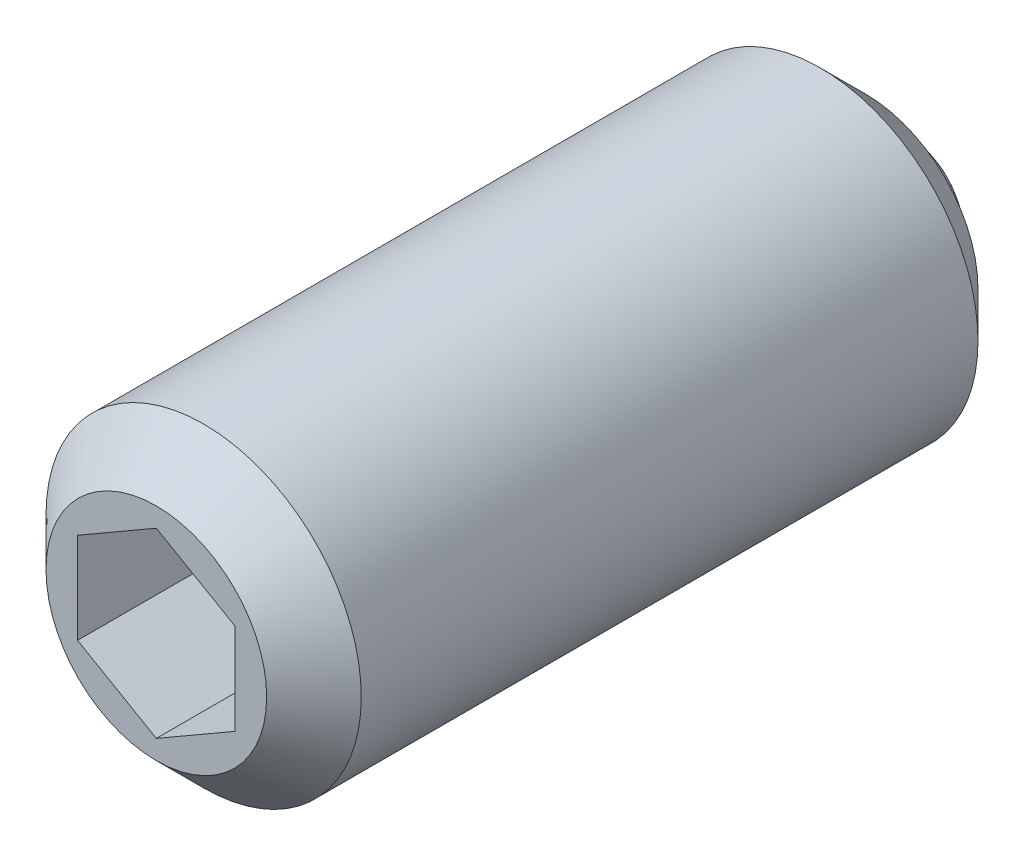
ISO-10303-21;
HEADER;
FILE_DESCRIPTION(('STEP AP214'),'2;1');
FILE_NAME('part.step','',(''),(''),'','','');
FILE_SCHEMA(('AUTOMOTIVE_DESIGN { 1 0 10303 214 1 1 1 1 }'));
ENDSEC;
DATA;
#1=APPLICATION_CONTEXT('core data for automotive mechanical design processes');
#2=APPLICATION_PROTOCOL_DEFINITION('international standard','automotive_design',2000,#1);
#3=PRODUCT_CONTEXT('',#1,'mechanical');
#4=PRODUCT('Part','Part','',(#3));
#5=PRODUCT_RELATED_PRODUCT_CATEGORY('part','',(#4));
#6=PRODUCT_DEFINITION_FORMATION('','',#4);
#7=PRODUCT_DEFINITION_CONTEXT('part definition',#1,'design');
#8=PRODUCT_DEFINITION('design','',#6,#7);
#9=PRODUCT_DEFINITION_SHAPE('','',#8);
#10=(LENGTH_UNIT() NAMED_UNIT(*) SI_UNIT(.MILLI.,.METRE.));
#11=(NAMED_UNIT(*) PLANE_ANGLE_UNIT() SI_UNIT($,.RADIAN.));
#12=(NAMED_UNIT(*) SI_UNIT($,.STERADIAN.) SOLID_ANGLE_UNIT());
#13=UNCERTAINTY_MEASURE_WITH_UNIT(LENGTH_MEASURE(1.E-05),#10,'distance_accuracy_value','');
#14=(GEOMETRIC_REPRESENTATION_CONTEXT(3) GLOBAL_UNCERTAINTY_ASSIGNED_CONTEXT((#13)) GLOBAL_UNIT_ASSIGNED_CONTEXT((#10,
#11,#12)) REPRESENTATION_CONTEXT('',''));
#15=CARTESIAN_POINT('',(0.,0.,0.));
#16=DIRECTION('',(0.,0.,1.));
#17=DIRECTION('',(1.,0.,0.));
#18=AXIS2_PLACEMENT_3D('',#15,#16,#17);
#19=CARTESIAN_POINT('',(2.0000000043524,-2.33711386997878,15.4999999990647));
#20=DIRECTION('',(-2.80800014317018E-10,1.5992106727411E-10,-1.));
#21=DIRECTION('',(-1.,0.,2.80800014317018E-10));
#22=AXIS2_PLACEMENT_3D('',#19,#20,#21);
#23=PLANE('',#22);
#24=DIRECTION('',(-0.866025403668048,-0.500000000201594,1.63219412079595E-10));
#25=VECTOR('',#24,1.);
#26=CARTESIAN_POINT('',(-0.999999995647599,1.73205082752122,15.5000000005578));
#27=LINE('',#26,#25);
#28=CARTESIAN_POINT('',(3.78801077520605E-09,2.30940109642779,15.5000000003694));
#29=VERTEX_POINT('',#28);
#30=CARTESIAN_POINT('',(-1.9999999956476,1.15470055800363,15.5000000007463));
#31=VERTEX_POINT('',#30);
#32=EDGE_CURVE('E102',#29,#31,#27,.T.);
#33=ORIENTED_EDGE('',*,*,#32,.T.);
#34=DIRECTION('',(0.,-1.,-1.5992106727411E-10));
#35=VECTOR('',#34,1.);
#36=CARTESIAN_POINT('',(-1.9999999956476,2.00212238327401E-08,15.5000000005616));
#37=LINE('',#36,#35);
#38=CARTESIAN_POINT('',(-1.9999999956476,-1.15470051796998,15.500000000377));
#39=VERTEX_POINT('',#38);
#40=EDGE_CURVE('E84',#31,#39,#37,.T.);
#41=ORIENTED_EDGE('',*,*,#40,.T.);
#42=DIRECTION('',(0.866025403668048,-0.500000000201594,-3.23140479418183E-10));
#43=VECTOR('',#42,1.);
#44=CARTESIAN_POINT('',(-0.9999999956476,-1.73205078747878,15.5000000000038));
#45=LINE('',#44,#43);
#46=CARTESIAN_POINT('',(4.9167897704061E-09,-2.30940105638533,15.4999999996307));
#47=VERTEX_POINT('',#46);
#48=EDGE_CURVE('E88',#39,#47,#45,.T.);
#49=ORIENTED_EDGE('',*,*,#48,.T.);
#50=DIRECTION('',(0.866025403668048,0.500000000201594,-1.63219412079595E-10));
#51=VECTOR('',#50,1.);
#52=CARTESIAN_POINT('',(1.0000000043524,-1.73205078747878,15.4999999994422));
#53=LINE('',#52,#51);
#54=CARTESIAN_POINT('',(2.0000000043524,-1.15470051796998,15.4999999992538));
#55=VERTEX_POINT('',#54);
#56=EDGE_CURVE('E93',#47,#55,#53,.T.);
#57=ORIENTED_EDGE('',*,*,#56,.T.);
#58=DIRECTION('',(0.,1.,1.5992106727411E-10));
#59=VECTOR('',#58,1.);
#60=CARTESIAN_POINT('',(2.0000000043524,2.00212230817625E-08,15.4999999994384));
#61=LINE('',#60,#59);
#62=CARTESIAN_POINT('',(2.0000000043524,1.15470055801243,15.4999999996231));
#63=VERTEX_POINT('',#62);
#64=EDGE_CURVE('E96',#55,#63,#61,.T.);
#65=ORIENTED_EDGE('',*,*,#64,.T.);
#66=DIRECTION('',(-0.866025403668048,0.500000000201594,3.23140479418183E-10));
#67=VECTOR('',#66,1.);
#68=CARTESIAN_POINT('',(1.0000000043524,1.73205082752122,15.4999999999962));
#69=LINE('',#68,#67);
#70=EDGE_CURVE('E99',#63,#29,#69,.T.);
#71=ORIENTED_EDGE('',*,*,#70,.T.);
#72=EDGE_LOOP('',(#33,#41,#49,#57,#65,#71));
#73=FACE_BOUND('',#72,.T.);
#74=ADVANCED_FACE('F14',(#73),#23,.F.);
#75=CARTESIAN_POINT('',(-1.9999999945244,-1.15470051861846,19.500000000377));
#76=DIRECTION('',(-1.,0.,2.80800014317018E-10));
#77=DIRECTION('',(0.,1.,1.5992106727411E-10));
#78=AXIS2_PLACEMENT_3D('',#75,#76,#77);
#79=PLANE('',#78);
#80=DIRECTION('',(-2.80800014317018E-10,1.5992106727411E-10,-1.));
#81=VECTOR('',#80,1.);
#82=CARTESIAN_POINT('',(-1.999999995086,-1.15470051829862,17.500000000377));
#83=LINE('',#82,#81);
#84=CARTESIAN_POINT('',(-1.9999999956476,-1.15470051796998,19.500000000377));
#85=VERTEX_POINT('',#84);
#86=EDGE_CURVE('E85',#85,#39,#83,.T.);
#87=ORIENTED_EDGE('',*,*,#86,.T.);
#88=ORIENTED_EDGE('',*,*,#40,.F.);
#89=DIRECTION('',(2.80800014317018E-10,-1.5992106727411E-10,1.));
#90=VECTOR('',#89,1.);
#91=CARTESIAN_POINT('',(-1.999999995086,1.15470055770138,17.5000000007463));
#92=LINE('',#91,#90);
#93=CARTESIAN_POINT('',(-1.9999999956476,1.15470055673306,19.5000000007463));
#94=VERTEX_POINT('',#93);
#95=EDGE_CURVE('E54',#31,#94,#92,.T.);
#96=ORIENTED_EDGE('',*,*,#95,.T.);
#97=DIRECTION('',(0.,-1.,-1.5992106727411E-10));
#98=VECTOR('',#97,1.);
#99=CARTESIAN_POINT('',(-1.9999999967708,1.93815395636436E-08,19.5000000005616));
#100=LINE('',#99,#98);
#101=EDGE_CURVE('E48',#94,#85,#100,.T.);
#102=ORIENTED_EDGE('',*,*,#101,.T.);
#103=EDGE_LOOP('',(#87,#88,#96,#102));
#104=FACE_BOUND('',#103,.T.);
#105=ADVANCED_FACE('F150',(#104),#79,.F.);
#106=CARTESIAN_POINT('',(5.47559984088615E-09,-2.30940105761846,19.4999999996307));
#107=DIRECTION('',(-0.500000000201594,-0.866025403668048,1.90430037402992E-12));
#108=DIRECTION('',(-0.866025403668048,0.500000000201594,3.23140479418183E-10));
#109=AXIS2_PLACEMENT_3D('',#106,#107,#108);
#110=PLANE('',#109);
#111=DIRECTION('',(-2.80800014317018E-10,1.5992106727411E-10,-1.));
#112=VECTOR('',#111,1.);
#113=CARTESIAN_POINT('',(4.91399981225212E-09,-2.30940105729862,17.4999999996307));
#114=LINE('',#113,#112);
#115=CARTESIAN_POINT('',(5.47559989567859E-09,-2.30940105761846,19.4999999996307));
#116=VERTEX_POINT('',#115);
#117=EDGE_CURVE('E92',#116,#47,#114,.T.);
#118=ORIENTED_EDGE('',*,*,#117,.T.);
#119=ORIENTED_EDGE('',*,*,#48,.F.);
#120=ORIENTED_EDGE('',*,*,#86,.F.);
#121=DIRECTION('',(-0.866025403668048,0.500000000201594,3.23140479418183E-10));
#122=VECTOR('',#121,1.);
#123=CARTESIAN_POINT('',(5.47559984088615E-09,-2.30940105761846,19.4999999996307));
#124=LINE('',#123,#122);
#125=EDGE_CURVE('E120',#85,#116,#124,.F.);
#126=ORIENTED_EDGE('',*,*,#125,.T.);
#127=EDGE_LOOP('',(#118,#119,#120,#126));
#128=FACE_BOUND('',#127,.T.);
#129=ADVANCED_FACE('F131',(#128),#110,.F.);
#130=CARTESIAN_POINT('',(2.0000000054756,-1.15470051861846,19.4999999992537));
#131=DIRECTION('',(0.500000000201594,-0.866025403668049,-2.78895714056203E-10));
#132=DIRECTION('',(-0.866025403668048,-0.500000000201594,1.63219412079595E-10));
#133=AXIS2_PLACEMENT_3D('',#130,#131,#132);
#134=PLANE('',#133);
#135=DIRECTION('',(-2.80800014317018E-10,1.5992106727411E-10,-1.));
#136=VECTOR('',#135,1.);
#137=CARTESIAN_POINT('',(2.000000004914,-1.15470051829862,17.4999999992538));
#138=LINE('',#137,#136);
#139=CARTESIAN_POINT('',(2.0000000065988,-1.15470051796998,19.4999999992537));
#140=VERTEX_POINT('',#139);
#141=EDGE_CURVE('E95',#140,#55,#138,.T.);
#142=ORIENTED_EDGE('',*,*,#141,.T.);
#143=ORIENTED_EDGE('',*,*,#56,.F.);
#144=ORIENTED_EDGE('',*,*,#117,.F.);
#145=DIRECTION('',(-0.866025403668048,-0.500000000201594,1.63219412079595E-10));
#146=VECTOR('',#145,1.);
#147=CARTESIAN_POINT('',(2.0000000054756,-1.15470051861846,19.4999999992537));
#148=LINE('',#147,#146);
#149=EDGE_CURVE('E112',#116,#140,#148,.F.);
#150=ORIENTED_EDGE('',*,*,#149,.T.);
#151=EDGE_LOOP('',(#142,#143,#144,#150));
#152=FACE_BOUND('',#151,.T.);
#153=ADVANCED_FACE('F137',(#152),#134,.F.);
#154=CARTESIAN_POINT('',(2.0000000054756,1.15470055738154,19.499999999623));
#155=DIRECTION('',(1.,0.,-2.80800014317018E-10));
#156=DIRECTION('',(0.,-1.,-1.5992106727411E-10));
#157=AXIS2_PLACEMENT_3D('',#154,#155,#156);
#158=PLANE('',#157);
#159=DIRECTION('',(-2.80800014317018E-10,1.5992106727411E-10,-1.));
#160=VECTOR('',#159,1.);
#161=CARTESIAN_POINT('',(2.000000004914,1.15470055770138,17.499999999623));
#162=LINE('',#161,#160);
#163=CARTESIAN_POINT('',(2.0000000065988,1.15470055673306,19.499999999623));
#164=VERTEX_POINT('',#163);
#165=EDGE_CURVE('E98',#164,#63,#162,.T.);
#166=ORIENTED_EDGE('',*,*,#165,.T.);
#167=ORIENTED_EDGE('',*,*,#64,.F.);
#168=ORIENTED_EDGE('',*,*,#141,.F.);
#169=DIRECTION('',(0.,1.,1.5992106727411E-10));
#170=VECTOR('',#169,1.);
#171=CARTESIAN_POINT('',(2.000000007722,1.9381538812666E-08,19.4999999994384));
#172=LINE('',#171,#170);
#173=EDGE_CURVE('E110',#140,#164,#172,.T.);
#174=ORIENTED_EDGE('',*,*,#173,.T.);
#175=EDGE_LOOP('',(#166,#167,#168,#174));
#176=FACE_BOUND('',#175,.T.);
#177=ADVANCED_FACE('F144',(#176),#158,.F.);
#178=CARTESIAN_POINT('',(5.47560070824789E-09,2.30940109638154,19.5000000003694));
#179=DIRECTION('',(0.500000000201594,0.866025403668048,-1.90430037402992E-12));
#180=DIRECTION('',(0.866025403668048,-0.500000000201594,-3.23140479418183E-10));
#181=AXIS2_PLACEMENT_3D('',#178,#179,#180);
#182=PLANE('',#181);
#183=DIRECTION('',(-2.80800014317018E-10,1.5992106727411E-10,-1.));
#184=VECTOR('',#183,1.);
#185=CARTESIAN_POINT('',(4.91400067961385E-09,2.30940109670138,17.5000000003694));
#186=LINE('',#185,#184);
#187=CARTESIAN_POINT('',(5.47560053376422E-09,2.30940109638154,19.5000000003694));
#188=VERTEX_POINT('',#187);
#189=EDGE_CURVE('E101',#188,#29,#186,.T.);
#190=ORIENTED_EDGE('',*,*,#189,.T.);
#191=ORIENTED_EDGE('',*,*,#70,.F.);
#192=ORIENTED_EDGE('',*,*,#165,.F.);
#193=DIRECTION('',(0.866025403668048,-0.500000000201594,-3.23140479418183E-10));
#194=VECTOR('',#193,1.);
#195=CARTESIAN_POINT('',(5.47560070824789E-09,2.30940109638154,19.5000000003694));
#196=LINE('',#195,#194);
#197=EDGE_CURVE('E33',#164,#188,#196,.F.);
#198=ORIENTED_EDGE('',*,*,#197,.T.);
#199=EDGE_LOOP('',(#190,#191,#192,#198));
#200=FACE_BOUND('',#199,.T.);
#201=ADVANCED_FACE('F147',(#200),#182,.F.);
#202=CARTESIAN_POINT('',(-1.9999999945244,1.15470055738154,19.5000000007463));
#203=DIRECTION('',(-0.500000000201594,0.866025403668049,2.78895714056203E-10));
#204=DIRECTION('',(0.866025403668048,0.500000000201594,-1.63219412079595E-10));
#205=AXIS2_PLACEMENT_3D('',#202,#203,#204);
#206=PLANE('',#205);
#207=ORIENTED_EDGE('',*,*,#95,.F.);
#208=ORIENTED_EDGE('',*,*,#32,.F.);
#209=ORIENTED_EDGE('',*,*,#189,.F.);
#210=DIRECTION('',(0.866025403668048,0.500000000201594,-1.63219412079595E-10));
#211=VECTOR('',#210,1.);
#212=CARTESIAN_POINT('',(-1.9999999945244,1.15470055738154,19.5000000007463));
#213=LINE('',#212,#211);
#214=EDGE_CURVE('E125',#188,#94,#213,.F.);
#215=ORIENTED_EDGE('',*,*,#214,.T.);
#216=EDGE_LOOP('',(#207,#208,#209,#215));
#217=FACE_BOUND('',#216,.T.);
#218=ADVANCED_FACE('F151',(#217),#206,.F.);
#219=CARTESIAN_POINT('',(2.8336000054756,-2.84335031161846,19.4999999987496));
#220=DIRECTION('',(-2.80800014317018E-10,1.5992106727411E-10,-1.));
#221=DIRECTION('',(-1.,0.,2.80800014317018E-10));
#222=AXIS2_PLACEMENT_3D('',#219,#220,#221);
#223=PLANE('',#222);
#224=ORIENTED_EDGE('',*,*,#197,.F.);
#225=ORIENTED_EDGE('',*,*,#173,.F.);
#226=ORIENTED_EDGE('',*,*,#149,.F.);
#227=ORIENTED_EDGE('',*,*,#125,.F.);
#228=ORIENTED_EDGE('',*,*,#101,.F.);
#229=ORIENTED_EDGE('',*,*,#214,.F.);
#230=EDGE_LOOP('',(#224,#225,#226,#227,#228,#229));
#231=FACE_BOUND('',#230,.T.);
#232=CARTESIAN_POINT('',(5.47560027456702E-09,1.93815391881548E-08,19.5));
#233=DIRECTION('',(-2.80800014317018E-10,1.5992106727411E-10,-1.));
#234=DIRECTION('',(-1.,0.,2.80800014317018E-10));
#235=AXIS2_PLACEMENT_3D('',#232,#233,#234);
#236=CIRCLE('',#235,2.8);
#237=CARTESIAN_POINT('',(-2.7999999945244,1.93815397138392E-08,19.5000000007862));
#238=VERTEX_POINT('',#237);
#239=EDGE_CURVE('E109',#238,#238,#236,.T.);
#240=ORIENTED_EDGE('',*,*,#239,.F.);
#241=EDGE_LOOP('',(#240));
#242=FACE_BOUND('',#241,.T.);
#243=ADVANCED_FACE('F140',(#231,#242),#223,.F.);
#244=CARTESIAN_POINT('',(5.47560027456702E-09,1.93815391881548E-08,19.5));
#245=DIRECTION('',(-2.80800014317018E-10,1.5992106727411E-10,-1.));
#246=DIRECTION('',(-1.,0.,2.80800014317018E-10));
#247=AXIS2_PLACEMENT_3D('',#244,#245,#246);
#248=CONICAL_SURFACE('',#247,2.8,0.785398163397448);
#249=CARTESIAN_POINT('',(5.1386402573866E-09,1.95734444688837E-08,18.3));
#250=DIRECTION('',(2.80800014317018E-10,-1.5992106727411E-10,1.));
#251=DIRECTION('',(1.,0.,-2.80800014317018E-10));
#252=AXIS2_PLACEMENT_3D('',#249,#250,#251);
#253=CIRCLE('',#252,4.);
#254=CARTESIAN_POINT('',(4.00000000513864,1.95734437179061E-08,18.2999999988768));
#255=VERTEX_POINT('',#254);
#256=EDGE_CURVE('E106',#255,#255,#253,.F.);
#257=ORIENTED_EDGE('',*,*,#256,.F.);
#258=EDGE_LOOP('',(#257));
#259=FACE_BOUND('',#258,.T.);
#260=ORIENTED_EDGE('',*,*,#239,.T.);
#261=EDGE_LOOP('',(#260));
#262=FACE_BOUND('',#261,.T.);
#263=ADVANCED_FACE('F160',(#259,#262),#248,.T.);
#264=CARTESIAN_POINT('',(7.44120033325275E-10,2.20762091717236E-08,2.65));
#265=DIRECTION('',(2.80800014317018E-10,-1.5992106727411E-10,1.));
#266=DIRECTION('',(1.,0.,-2.80800014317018E-10));
#267=AXIS2_PLACEMENT_3D('',#264,#265,#266);
#268=CYLINDRICAL_SURFACE('',#267,4.);
#269=ORIENTED_EDGE('',*,*,#256,.T.);
#270=EDGE_LOOP('',(#269));
#271=FACE_BOUND('',#270,.T.);
#272=CARTESIAN_POINT('',(7.44120033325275E-10,2.20762091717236E-08,2.65));
#273=DIRECTION('',(2.80800014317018E-10,-1.5992106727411E-10,1.));
#274=DIRECTION('',(1.,0.,-2.80800014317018E-10));
#275=AXIS2_PLACEMENT_3D('',#272,#273,#274);
#276=CIRCLE('',#275,4.);
#277=CARTESIAN_POINT('',(4.00000000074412,2.20762084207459E-08,2.6499999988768));
#278=VERTEX_POINT('',#277);
#279=EDGE_CURVE('E24',#278,#278,#276,.F.);
#280=ORIENTED_EDGE('',*,*,#279,.F.);
#281=EDGE_LOOP('',(#280));
#282=FACE_BOUND('',#281,.T.);
#283=ADVANCED_FACE('F168',(#271,#282),#268,.T.);
#284=CARTESIAN_POINT('',(4.21200016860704E-10,2.22601183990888E-08,1.5));
#285=DIRECTION('',(2.80800014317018E-10,-1.5992106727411E-10,1.));
#286=DIRECTION('',(1.,0.,-2.80800014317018E-10));
#287=AXIS2_PLACEMENT_3D('',#284,#285,#286);
#288=CONICAL_SURFACE('',#287,2.85,0.785398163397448);
#289=ORIENTED_EDGE('',*,*,#279,.T.);
#290=EDGE_LOOP('',(#289));
#291=FACE_BOUND('',#290,.T.);
#292=CARTESIAN_POINT('',(4.21200016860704E-10,2.22601183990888E-08,1.5));
#293=DIRECTION('',(2.80800014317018E-10,-1.5992106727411E-10,1.));
#294=DIRECTION('',(1.,0.,-2.80800014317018E-10));
#295=AXIS2_PLACEMENT_3D('',#292,#293,#294);
#296=CIRCLE('',#295,2.85);
#297=CARTESIAN_POINT('',(2.8500000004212,2.22601178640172E-08,1.49999999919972));
#298=VERTEX_POINT('',#297);
#299=EDGE_CURVE('E9',#298,#298,#296,.T.);
#300=ORIENTED_EDGE('',*,*,#299,.T.);
#301=EDGE_LOOP('',(#300));
#302=FACE_BOUND('',#301,.T.);
#303=ADVANCED_FACE('F163',(#291,#302),#288,.T.);
#304=CARTESIAN_POINT('',(-2.8841999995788,-2.89412442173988,1.50000000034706));
#305=DIRECTION('',(2.80800014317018E-10,-1.5992106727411E-10,1.));
#306=DIRECTION('',(1.,0.,-2.80800014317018E-10));
#307=AXIS2_PLACEMENT_3D('',#304,#305,#306);
#308=PLANE('',#307);
#309=CARTESIAN_POINT('',(-2.80800014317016E-10,1.5992106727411E-10,1.5));
#310=DIRECTION('',(2.80800014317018E-10,-1.5992106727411E-10,1.));
#311=DIRECTION('',(1.,0.,-2.80800014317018E-10));
#312=AXIS2_PLACEMENT_3D('',#309,#310,#311);
#313=CIRCLE('',#312,2.29128784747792);
#314=CARTESIAN_POINT('',(2.29128784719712,1.5992106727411E-10,1.49999999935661));
#315=VERTEX_POINT('',#314);
#316=EDGE_CURVE('E18',#315,#315,#313,.T.);
#317=ORIENTED_EDGE('',*,*,#316,.T.);
#318=EDGE_LOOP('',(#317));
#319=FACE_BOUND('',#318,.T.);
#320=ORIENTED_EDGE('',*,*,#299,.F.);
#321=EDGE_LOOP('',(#320));
#322=FACE_BOUND('',#321,.T.);
#323=ADVANCED_FACE('F16',(#319,#322),#308,.F.);
#324=CARTESIAN_POINT('',(0.,0.,2.5));
#325=DIRECTION('',(0.,0.,-1.));
#326=DIRECTION('',(1.,0.,0.));
#327=AXIS2_PLACEMENT_3D('',#324,#325,#326);
#328=SPHERICAL_SURFACE('',#327,2.5);
#329=CARTESIAN_POINT('',(0.,2.25E-08,0.));
#330=VERTEX_POINT('',#329);
#331=VERTEX_LOOP('',#330);
#332=FACE_BOUND('',#331,.T.);
#333=ORIENTED_EDGE('',*,*,#316,.F.);
#334=EDGE_LOOP('',(#333));
#335=FACE_BOUND('',#334,.T.);
#336=ADVANCED_FACE('F77',(#332,#335),#328,.T.);
#337=CLOSED_SHELL('',(#74,#105,#129,#153,#177,#201,#218,#243,#263,#283,#303,#323,#336));
#338=MANIFOLD_SOLID_BREP('B1',#337);
#339=ADVANCED_BREP_SHAPE_REPRESENTATION('',(#18,#338),#14);
#340=SHAPE_DEFINITION_REPRESENTATION(#9,#339);
ENDSEC;
END-ISO-10303-21;
